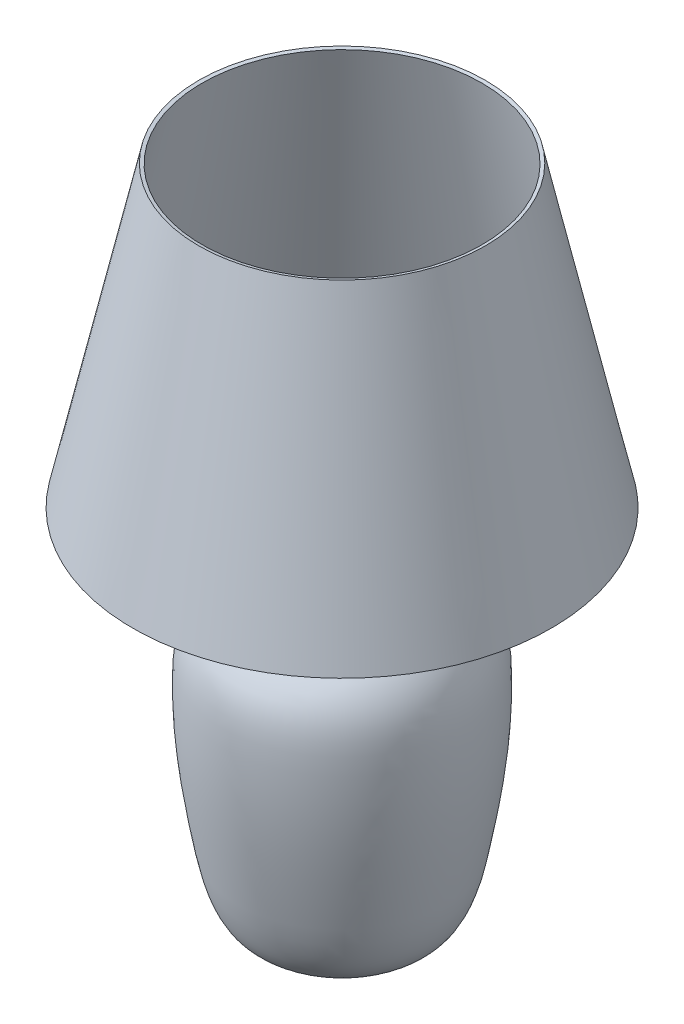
ISO-10303-21;
HEADER;
FILE_DESCRIPTION(('STEP AP214'),'2;1');
FILE_NAME('part.step','',(''),(''),'','','');
FILE_SCHEMA(('AUTOMOTIVE_DESIGN { 1 0 10303 214 1 1 1 1 }'));
ENDSEC;
DATA;
#1=APPLICATION_CONTEXT('core data for automotive mechanical design processes');
#2=APPLICATION_PROTOCOL_DEFINITION('international standard','automotive_design',2000,#1);
#3=PRODUCT_CONTEXT('',#1,'mechanical');
#4=PRODUCT('Part','Part','',(#3));
#5=PRODUCT_RELATED_PRODUCT_CATEGORY('part','',(#4));
#6=PRODUCT_DEFINITION_FORMATION('','',#4);
#7=PRODUCT_DEFINITION_CONTEXT('part definition',#1,'design');
#8=PRODUCT_DEFINITION('design','',#6,#7);
#9=PRODUCT_DEFINITION_SHAPE('','',#8);
#10=(LENGTH_UNIT() NAMED_UNIT(*) SI_UNIT(.MILLI.,.METRE.));
#11=(NAMED_UNIT(*) PLANE_ANGLE_UNIT() SI_UNIT($,.RADIAN.));
#12=(NAMED_UNIT(*) SI_UNIT($,.STERADIAN.) SOLID_ANGLE_UNIT());
#13=UNCERTAINTY_MEASURE_WITH_UNIT(LENGTH_MEASURE(1.E-05),#10,'distance_accuracy_value','');
#14=(GEOMETRIC_REPRESENTATION_CONTEXT(3) GLOBAL_UNCERTAINTY_ASSIGNED_CONTEXT((#13)) GLOBAL_UNIT_ASSIGNED_CONTEXT((#10,
#11,#12)) REPRESENTATION_CONTEXT('',''));
#15=CARTESIAN_POINT('',(0.,0.,0.));
#16=DIRECTION('',(0.,0.,1.));
#17=DIRECTION('',(1.,0.,0.));
#18=AXIS2_PLACEMENT_3D('',#15,#16,#17);
#19=CARTESIAN_POINT('',(833.044820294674,191.839921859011,0.));
#20=DIRECTION('',(0.,1.,0.));
#21=DIRECTION('',(0.,0.,1.));
#22=AXIS2_PLACEMENT_3D('',#19,#20,#21);
#23=PLANE('',#22);
#24=CARTESIAN_POINT('',(822.943357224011,191.839921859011,0.));
#25=DIRECTION('',(0.,-1.,0.));
#26=DIRECTION('',(0.,0.,-1.));
#27=AXIS2_PLACEMENT_3D('',#24,#25,#26);
#28=CIRCLE('',#27,60.1921488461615);
#29=CARTESIAN_POINT('',(822.943357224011,191.839921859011,-60.1921488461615));
#30=VERTEX_POINT('',#29);
#31=EDGE_CURVE('E10',#30,#30,#28,.T.);
#32=ORIENTED_EDGE('',*,*,#31,.F.);
#33=EDGE_LOOP('',(#32));
#34=FACE_BOUND('',#33,.T.);
#35=ADVANCED_FACE('F31',(#34),#23,.T.);
#36=CARTESIAN_POINT('',(860.590856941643,467.510373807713,0.));
#37=CARTESIAN_POINT('',(860.66737812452,466.28928850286,0.));
#38=CARTESIAN_POINT('',(860.762718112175,465.166351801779,0.));
#39=CARTESIAN_POINT('',(861.033579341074,463.060859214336,0.));
#40=CARTESIAN_POINT('',(861.208798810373,462.077274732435,0.));
#41=CARTESIAN_POINT('',(861.701193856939,460.201468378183,0.));
#42=CARTESIAN_POINT('',(862.020193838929,459.307248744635,0.));
#43=CARTESIAN_POINT('',(862.869560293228,457.618033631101,0.));
#44=CARTESIAN_POINT('',(863.40246194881,456.826573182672,0.));
#45=CARTESIAN_POINT('',(864.353312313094,455.766179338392,0.));
#46=CARTESIAN_POINT('',(864.694536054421,455.43374557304,0.));
#47=CARTESIAN_POINT('',(865.418031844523,454.811842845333,0.));
#48=CARTESIAN_POINT('',(865.8020542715,454.521198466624,0.));
#49=CARTESIAN_POINT('',(866.993702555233,453.713875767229,0.));
#50=CARTESIAN_POINT('',(867.833639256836,453.260215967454,0.));
#51=CARTESIAN_POINT('',(869.566662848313,452.433487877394,0.));
#52=CARTESIAN_POINT('',(870.460600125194,452.061620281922,0.));
#53=CARTESIAN_POINT('',(872.262879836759,451.353777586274,0.));
#54=CARTESIAN_POINT('',(873.171195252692,451.018243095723,0.));
#55=CARTESIAN_POINT('',(874.950484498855,450.354003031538,0.));
#56=CARTESIAN_POINT('',(875.813675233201,450.025354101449,0.));
#57=CARTESIAN_POINT('',(877.527189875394,449.342833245,0.));
#58=CARTESIAN_POINT('',(880.06723696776,448.292246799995,0.));
#59=CARTESIAN_POINT('',(882.51508841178,447.162425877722,0.));
#60=CARTESIAN_POINT('',(887.283898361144,444.80030618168,0.));
#61=CARTESIAN_POINT('',(890.29386944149,443.088930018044,0.));
#62=CARTESIAN_POINT('',(898.785769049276,437.570245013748,0.));
#63=CARTESIAN_POINT('',(903.728853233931,433.379240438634,0.));
#64=CARTESIAN_POINT('',(912.035790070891,424.098056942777,0.));
#65=CARTESIAN_POINT('',(915.400795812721,419.008809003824,0.));
#66=CARTESIAN_POINT('',(918.539658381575,412.138548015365,0.));
#67=CARTESIAN_POINT('',(919.114028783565,410.73893279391,0.));
#68=CARTESIAN_POINT('',(920.153669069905,407.889410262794,0.));
#69=CARTESIAN_POINT('',(920.618013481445,406.438747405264,0.));
#70=CARTESIAN_POINT('',(921.863514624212,401.997800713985,0.));
#71=CARTESIAN_POINT('',(922.496413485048,398.926056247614,0.));
#72=CARTESIAN_POINT('',(923.940978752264,389.478208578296,0.));
#73=CARTESIAN_POINT('',(924.296060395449,382.870815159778,0.));
#74=CARTESIAN_POINT('',(924.481963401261,374.581472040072,0.));
#75=CARTESIAN_POINT('',(924.507212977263,372.921540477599,0.));
#76=CARTESIAN_POINT('',(924.540768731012,369.61357576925,0.));
#77=CARTESIAN_POINT('',(924.563214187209,364.664864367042,0.));
#78=CARTESIAN_POINT('',(924.503087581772,359.750939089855,0.));
#79=CARTESIAN_POINT('',(924.275626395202,349.956346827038,0.));
#80=CARTESIAN_POINT('',(923.981049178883,343.470956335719,0.));
#81=CARTESIAN_POINT('',(923.336180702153,333.756947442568,0.));
#82=CARTESIAN_POINT('',(923.087299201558,330.521237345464,0.));
#83=CARTESIAN_POINT('',(922.524156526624,324.045959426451,0.));
#84=CARTESIAN_POINT('',(922.210191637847,320.806962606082,0.));
#85=CARTESIAN_POINT('',(921.180426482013,311.087040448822,0.));
#86=CARTESIAN_POINT('',(920.376749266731,304.60318289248,0.));
#87=CARTESIAN_POINT('',(917.688938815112,285.149083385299,0.));
#88=CARTESIAN_POINT('',(915.527943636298,272.176356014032,0.));
#89=CARTESIAN_POINT('',(912.907002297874,257.605713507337,0.));
#90=CARTESIAN_POINT('',(912.613326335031,255.986145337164,0.));
#91=CARTESIAN_POINT('',(912.020780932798,252.753460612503,0.));
#92=CARTESIAN_POINT('',(911.721276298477,251.140415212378,0.));
#93=CARTESIAN_POINT('',(910.801758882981,246.314248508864,0.));
#94=CARTESIAN_POINT('',(910.160708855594,243.114108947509,0.));
#95=CARTESIAN_POINT('',(908.064217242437,233.589977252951,0.));
#96=CARTESIAN_POINT('',(906.435119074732,227.343012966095,0.));
#97=CARTESIAN_POINT('',(903.818802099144,219.737128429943,0.));
#98=CARTESIAN_POINT('',(903.266563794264,218.226034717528,0.));
#99=CARTESIAN_POINT('',(902.096904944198,215.225603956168,0.));
#100=CARTESIAN_POINT('',(901.481040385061,213.73698468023,0.));
#101=CARTESIAN_POINT('',(899.521307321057,209.361030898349,0.));
#102=CARTESIAN_POINT('',(898.061640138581,206.559485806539,0.));
#103=CARTESIAN_POINT('',(894.706151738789,201.402148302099,0.));
#104=CARTESIAN_POINT('',(892.812314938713,199.047570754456,0.));
#105=CARTESIAN_POINT('',(888.454398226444,194.953023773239,0.));
#106=CARTESIAN_POINT('',(885.992577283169,193.209866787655,0.));
#107=CARTESIAN_POINT('',(883.135506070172,191.839921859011,0.));
#108=B_SPLINE_CURVE_WITH_KNOTS('',3,(#36,#37,#38,#39,#40,#41,#42,#43,#44,#45,#46,#47,#48,#49,
#50,#51,#52,#53,#54,#55,#56,#57,#58,#59,#60,#61,#62,#63,#64,#65,#66,#67,#68,#69,#70,#71,#72,#73,
#74,#75,#76,#77,#78,#79,#80,#81,#82,#83,#84,#85,#86,#87,#88,#89,#90,#91,#92,#93,#94,#95,#96,#97,
#98,#99,#100,#101,#102,#103,#104,#105,#106,#107),.UNSPECIFIED.,.F.,.F.,(4,2,2,2,2,2,2,2,2,2,2,1,
2,2,2,2,2,2,2,2,2,1,2,2,2,2,2,2,2,2,2,2,2,2,2,2,4),(0.,0.00781249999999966,0.0156249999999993,
0.023437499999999,0.0312499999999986,0.0351562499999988,0.0390624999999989,0.0468749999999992,
0.0546874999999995,0.0624999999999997,0.0703125,0.0781250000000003,0.0937500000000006,
0.125000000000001,0.187500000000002,0.250000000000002,0.265625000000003,0.281250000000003,
0.312500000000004,0.375000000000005,0.390625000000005,0.406250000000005,0.437500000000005,
0.500000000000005,0.531250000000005,0.562500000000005,0.625000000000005,0.750000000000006,
0.765625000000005,0.781250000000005,0.812500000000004,0.875000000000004,0.890625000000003,
0.906250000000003,0.937500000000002,0.968750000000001,1.),.UNSPECIFIED.);
#109=CARTESIAN_POINT('',(822.943357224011,188.839921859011,0.));
#110=DIRECTION('',(0.,-1.,0.));
#111=AXIS1_PLACEMENT('',#109,#110);
#112=SURFACE_OF_REVOLUTION('',#108,#111);
#113=ORIENTED_EDGE('',*,*,#31,.T.);
#114=EDGE_LOOP('',(#113));
#115=FACE_BOUND('',#114,.T.);
#116=CARTESIAN_POINT('',(822.943357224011,467.510373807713,0.));
#117=DIRECTION('',(0.,-1.,0.));
#118=DIRECTION('',(0.,0.,-1.));
#119=AXIS2_PLACEMENT_3D('',#116,#117,#118);
#120=CIRCLE('',#119,37.6474997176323);
#121=CARTESIAN_POINT('',(822.943357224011,467.510373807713,-37.6474997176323));
#122=VERTEX_POINT('',#121);
#123=EDGE_CURVE('E37',#122,#122,#120,.T.);
#124=ORIENTED_EDGE('',*,*,#123,.F.);
#125=EDGE_LOOP('',(#124));
#126=FACE_BOUND('',#125,.T.);
#127=ADVANCED_FACE('F84',(#115,#126),#112,.F.);
#128=CARTESIAN_POINT('',(863.443357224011,467.510373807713,0.));
#129=DIRECTION('',(0.,-1.,0.));
#130=DIRECTION('',(0.,0.,-1.));
#131=AXIS2_PLACEMENT_3D('',#128,#129,#130);
#132=PLANE('',#131);
#133=ORIENTED_EDGE('',*,*,#123,.T.);
#134=EDGE_LOOP('',(#133));
#135=FACE_BOUND('',#134,.T.);
#136=CARTESIAN_POINT('',(822.943357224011,467.510373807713,0.));
#137=DIRECTION('',(0.,-1.,0.));
#138=DIRECTION('',(0.,0.,-1.));
#139=AXIS2_PLACEMENT_3D('',#136,#137,#138);
#140=CIRCLE('',#139,4.49999999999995);
#141=CARTESIAN_POINT('',(822.943357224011,467.510373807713,-4.49999999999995));
#142=VERTEX_POINT('',#141);
#143=EDGE_CURVE('E41',#142,#142,#140,.T.);
#144=ORIENTED_EDGE('',*,*,#143,.F.);
#145=EDGE_LOOP('',(#144));
#146=FACE_BOUND('',#145,.T.);
#147=ADVANCED_FACE('F87',(#135,#146),#132,.T.);
#148=CARTESIAN_POINT('',(822.943357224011,188.839921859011,0.));
#149=DIRECTION('',(0.,-1.,0.));
#150=DIRECTION('',(0.,0.,-1.));
#151=AXIS2_PLACEMENT_3D('',#148,#149,#150);
#152=CYLINDRICAL_SURFACE('',#151,4.49999999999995);
#153=ORIENTED_EDGE('',*,*,#143,.T.);
#154=EDGE_LOOP('',(#153));
#155=FACE_BOUND('',#154,.T.);
#156=CARTESIAN_POINT('',(822.943357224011,503.510373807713,0.));
#157=DIRECTION('',(0.,-1.,0.));
#158=DIRECTION('',(0.,0.,-1.));
#159=AXIS2_PLACEMENT_3D('',#156,#157,#158);
#160=CIRCLE('',#159,4.49999999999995);
#161=CARTESIAN_POINT('',(822.943357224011,503.510373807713,-4.49999999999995));
#162=VERTEX_POINT('',#161);
#163=EDGE_CURVE('E45',#162,#162,#160,.T.);
#164=ORIENTED_EDGE('',*,*,#163,.F.);
#165=EDGE_LOOP('',(#164));
#166=FACE_BOUND('',#165,.T.);
#167=ADVANCED_FACE('F90',(#155,#166),#152,.F.);
#168=CARTESIAN_POINT('',(830.443357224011,503.510373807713,0.));
#169=DIRECTION('',(0.,1.,0.));
#170=DIRECTION('',(0.,0.,1.));
#171=AXIS2_PLACEMENT_3D('',#168,#169,#170);
#172=PLANE('',#171);
#173=ORIENTED_EDGE('',*,*,#163,.T.);
#174=EDGE_LOOP('',(#173));
#175=FACE_BOUND('',#174,.T.);
#176=CARTESIAN_POINT('',(822.943357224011,503.510373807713,0.));
#177=DIRECTION('',(0.,-1.,0.));
#178=DIRECTION('',(0.,0.,-1.));
#179=AXIS2_PLACEMENT_3D('',#176,#177,#178);
#180=CIRCLE('',#179,178.764050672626);
#181=CARTESIAN_POINT('',(822.943357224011,503.510373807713,-178.764050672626));
#182=VERTEX_POINT('',#181);
#183=EDGE_CURVE('E50',#182,#182,#180,.T.);
#184=ORIENTED_EDGE('',*,*,#183,.F.);
#185=EDGE_LOOP('',(#184));
#186=FACE_BOUND('',#185,.T.);
#187=ADVANCED_FACE('F93',(#175,#186),#172,.T.);
#188=CARTESIAN_POINT('',(822.943357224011,759.862565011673,0.));
#189=DIRECTION('',(0.,-1.,0.));
#190=DIRECTION('',(0.,0.,-1.));
#191=AXIS2_PLACEMENT_3D('',#188,#189,#190);
#192=CONICAL_SURFACE('',#191,122.070777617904,0.217650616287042);
#193=ORIENTED_EDGE('',*,*,#183,.T.);
#194=EDGE_LOOP('',(#193));
#195=FACE_BOUND('',#194,.T.);
#196=CARTESIAN_POINT('',(822.943357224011,759.862565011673,0.));
#197=DIRECTION('',(0.,-1.,0.));
#198=DIRECTION('',(0.,0.,-1.));
#199=AXIS2_PLACEMENT_3D('',#196,#197,#198);
#200=CIRCLE('',#199,122.070777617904);
#201=CARTESIAN_POINT('',(822.943357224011,759.862565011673,-122.070777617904));
#202=VERTEX_POINT('',#201);
#203=EDGE_CURVE('E53',#202,#202,#200,.T.);
#204=ORIENTED_EDGE('',*,*,#203,.F.);
#205=EDGE_LOOP('',(#204));
#206=FACE_BOUND('',#205,.T.);
#207=ADVANCED_FACE('F97',(#195,#206),#192,.F.);
#208=CARTESIAN_POINT('',(822.943357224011,759.862565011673,0.));
#209=DIRECTION('',(0.,1.,0.));
#210=DIRECTION('',(0.,0.,1.));
#211=AXIS2_PLACEMENT_3D('',#208,#209,#210);
#212=CONICAL_SURFACE('',#211,122.070777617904,1.3531457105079);
#213=CARTESIAN_POINT('',(822.943357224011,760.510373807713,0.));
#214=DIRECTION('',(0.,-1.,0.));
#215=DIRECTION('',(0.,0.,-1.));
#216=AXIS2_PLACEMENT_3D('',#213,#214,#215);
#217=CIRCLE('',#216,125.);
#218=CARTESIAN_POINT('',(822.943357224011,760.510373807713,-125.));
#219=VERTEX_POINT('',#218);
#220=EDGE_CURVE('E56',#219,#219,#217,.T.);
#221=ORIENTED_EDGE('',*,*,#220,.F.);
#222=EDGE_LOOP('',(#221));
#223=FACE_BOUND('',#222,.T.);
#224=ORIENTED_EDGE('',*,*,#203,.T.);
#225=EDGE_LOOP('',(#224));
#226=FACE_BOUND('',#225,.T.);
#227=ADVANCED_FACE('F101',(#223,#226),#212,.F.);
#228=CARTESIAN_POINT('',(822.943357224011,760.510373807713,0.));
#229=DIRECTION('',(0.,-1.,0.));
#230=DIRECTION('',(0.,0.,-1.));
#231=AXIS2_PLACEMENT_3D('',#228,#229,#230);
#232=CONICAL_SURFACE('',#231,125.,0.217650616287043);
#233=CARTESIAN_POINT('',(822.943357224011,500.510373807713,0.));
#234=DIRECTION('',(0.,-1.,0.));
#235=DIRECTION('',(0.,0.,-1.));
#236=AXIS2_PLACEMENT_3D('',#233,#234,#235);
#237=CIRCLE('',#236,182.5);
#238=CARTESIAN_POINT('',(822.943357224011,500.510373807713,-182.5));
#239=VERTEX_POINT('',#238);
#240=EDGE_CURVE('E59',#239,#239,#237,.T.);
#241=ORIENTED_EDGE('',*,*,#240,.F.);
#242=EDGE_LOOP('',(#241));
#243=FACE_BOUND('',#242,.T.);
#244=ORIENTED_EDGE('',*,*,#220,.T.);
#245=EDGE_LOOP('',(#244));
#246=FACE_BOUND('',#245,.T.);
#247=ADVANCED_FACE('F105',(#243,#246),#232,.T.);
#248=CARTESIAN_POINT('',(830.443357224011,500.510373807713,0.));
#249=DIRECTION('',(0.,1.,0.));
#250=DIRECTION('',(0.,0.,1.));
#251=AXIS2_PLACEMENT_3D('',#248,#249,#250);
#252=PLANE('',#251);
#253=CARTESIAN_POINT('',(822.943357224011,500.510373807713,0.));
#254=DIRECTION('',(0.,-1.,0.));
#255=DIRECTION('',(0.,0.,-1.));
#256=AXIS2_PLACEMENT_3D('',#253,#254,#255);
#257=CIRCLE('',#256,7.49999999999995);
#258=CARTESIAN_POINT('',(822.943357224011,500.510373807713,-7.49999999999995));
#259=VERTEX_POINT('',#258);
#260=EDGE_CURVE('E62',#259,#259,#257,.T.);
#261=ORIENTED_EDGE('',*,*,#260,.F.);
#262=EDGE_LOOP('',(#261));
#263=FACE_BOUND('',#262,.T.);
#264=ORIENTED_EDGE('',*,*,#240,.T.);
#265=EDGE_LOOP('',(#264));
#266=FACE_BOUND('',#265,.T.);
#267=ADVANCED_FACE('F109',(#263,#266),#252,.F.);
#268=CARTESIAN_POINT('',(822.943357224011,188.839921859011,0.));
#269=DIRECTION('',(0.,-1.,0.));
#270=DIRECTION('',(0.,0.,-1.));
#271=AXIS2_PLACEMENT_3D('',#268,#269,#270);
#272=CYLINDRICAL_SURFACE('',#271,7.49999999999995);
#273=CARTESIAN_POINT('',(822.943357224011,470.510373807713,0.));
#274=DIRECTION('',(0.,-1.,0.));
#275=DIRECTION('',(0.,0.,-1.));
#276=AXIS2_PLACEMENT_3D('',#273,#274,#275);
#277=CIRCLE('',#276,7.49999999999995);
#278=CARTESIAN_POINT('',(822.943357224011,470.510373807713,-7.49999999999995));
#279=VERTEX_POINT('',#278);
#280=EDGE_CURVE('E65',#279,#279,#277,.T.);
#281=ORIENTED_EDGE('',*,*,#280,.F.);
#282=EDGE_LOOP('',(#281));
#283=FACE_BOUND('',#282,.T.);
#284=ORIENTED_EDGE('',*,*,#260,.T.);
#285=EDGE_LOOP('',(#284));
#286=FACE_BOUND('',#285,.T.);
#287=ADVANCED_FACE('F113',(#283,#286),#272,.T.);
#288=CARTESIAN_POINT('',(863.443357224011,470.510373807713,0.));
#289=DIRECTION('',(0.,-1.,0.));
#290=DIRECTION('',(0.,0.,-1.));
#291=AXIS2_PLACEMENT_3D('',#288,#289,#290);
#292=PLANE('',#291);
#293=CARTESIAN_POINT('',(822.943357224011,470.510373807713,0.));
#294=DIRECTION('',(0.,-1.,0.));
#295=DIRECTION('',(0.,0.,-1.));
#296=AXIS2_PLACEMENT_3D('',#293,#294,#295);
#297=CIRCLE('',#296,40.5);
#298=CARTESIAN_POINT('',(822.943357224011,470.510373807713,-40.5));
#299=VERTEX_POINT('',#298);
#300=EDGE_CURVE('E68',#299,#299,#297,.T.);
#301=ORIENTED_EDGE('',*,*,#300,.F.);
#302=EDGE_LOOP('',(#301));
#303=FACE_BOUND('',#302,.T.);
#304=ORIENTED_EDGE('',*,*,#280,.T.);
#305=EDGE_LOOP('',(#304));
#306=FACE_BOUND('',#305,.T.);
#307=ADVANCED_FACE('F117',(#303,#306),#292,.F.);
#308=CARTESIAN_POINT('',(863.443357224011,470.510373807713,0.));
#309=CARTESIAN_POINT('',(863.762381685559,462.844119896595,0.));
#310=CARTESIAN_POINT('',(864.593667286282,457.082720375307,0.));
#311=CARTESIAN_POINT('',(897.377770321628,446.236505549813,0.));
#312=CARTESIAN_POINT('',(925.401639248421,420.325633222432,0.));
#313=CARTESIAN_POINT('',(928.147955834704,370.451463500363,0.));
#314=CARTESIAN_POINT('',(926.311054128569,319.439310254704,0.));
#315=CARTESIAN_POINT('',(917.835976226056,266.198130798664,0.));
#316=CARTESIAN_POINT('',(908.185160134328,216.672061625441,0.));
#317=CARTESIAN_POINT('',(894.94134470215,193.891514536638,0.));
#318=CARTESIAN_POINT('',(883.800269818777,188.839921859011,0.));
#319=B_SPLINE_CURVE_WITH_KNOTS('',3,(#308,#309,#310,#311,#312,#313,#314,#315,#316,#317,#318),
.UNSPECIFIED.,.F.,.F.,(4,1,1,1,1,1,1,1,4),(0.,0.0435987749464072,0.0710067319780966,
0.274079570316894,0.385891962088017,0.524977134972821,0.759995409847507,0.892201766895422,1.),.UNSPECIFIED.);
#320=CARTESIAN_POINT('',(822.943357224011,188.839921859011,0.));
#321=DIRECTION('',(0.,-1.,0.));
#322=AXIS1_PLACEMENT('',#320,#321);
#323=SURFACE_OF_REVOLUTION('',#319,#322);
#324=CARTESIAN_POINT('',(822.943357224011,188.839921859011,0.));
#325=DIRECTION('',(0.,-1.,0.));
#326=DIRECTION('',(0.,0.,-1.));
#327=AXIS2_PLACEMENT_3D('',#324,#325,#326);
#328=CIRCLE('',#327,60.8569125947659);
#329=CARTESIAN_POINT('',(822.943357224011,188.839921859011,-60.8569125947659));
#330=VERTEX_POINT('',#329);
#331=EDGE_CURVE('E71',#330,#330,#328,.T.);
#332=ORIENTED_EDGE('',*,*,#331,.F.);
#333=EDGE_LOOP('',(#332));
#334=FACE_BOUND('',#333,.T.);
#335=ORIENTED_EDGE('',*,*,#300,.T.);
#336=EDGE_LOOP('',(#335));
#337=FACE_BOUND('',#336,.T.);
#338=ADVANCED_FACE('F121',(#334,#337),#323,.T.);
#339=CARTESIAN_POINT('',(833.044820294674,188.839921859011,0.));
#340=DIRECTION('',(0.,1.,0.));
#341=DIRECTION('',(0.,0.,1.));
#342=AXIS2_PLACEMENT_3D('',#339,#340,#341);
#343=PLANE('',#342);
#344=ORIENTED_EDGE('',*,*,#331,.T.);
#345=EDGE_LOOP('',(#344));
#346=FACE_BOUND('',#345,.T.);
#347=ADVANCED_FACE('F125',(#346),#343,.F.);
#348=CLOSED_SHELL('',(#35,#127,#147,#167,#187,#207,#227,#247,#267,#287,#307,#338,#347));
#349=MANIFOLD_SOLID_BREP('B2',#348);
#350=ADVANCED_BREP_SHAPE_REPRESENTATION('',(#18,#349),#14);
#351=SHAPE_DEFINITION_REPRESENTATION(#9,#350);
ENDSEC;
END-ISO-10303-21;
